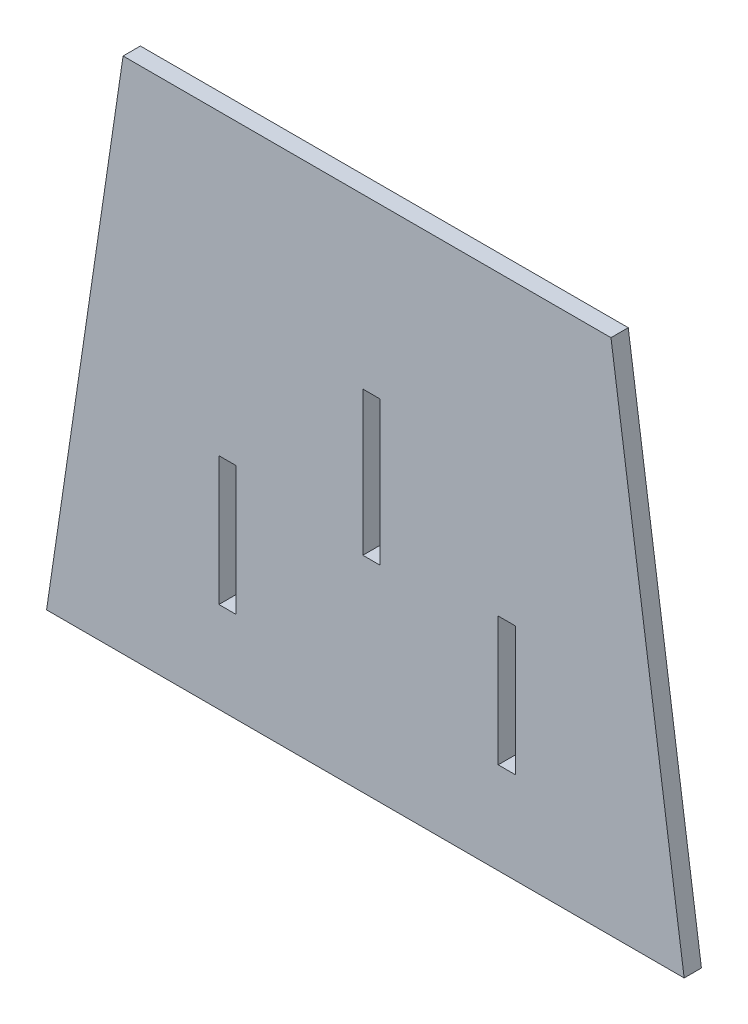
from build123d import *

# Parameters (mm, degrees)
SKETCH1_W           = 1.524
SKETCH1_H           = 12.7
BOSS_EXTRUDE1_DEPTH = 1.524
SKETCH2_W           = 1.524
SKETCH2_H           = 11.37039684
CUT_EXTRUDE1_DEPTH  = 2.54


with BuildPart() as part:
    # Sketch1 → Boss-Extrude1 (new body)
    with BuildSketch(Plane.XY):
        Polygon((28.343771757, -11.852606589), (-27.902219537, -11.852606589), (-21.152375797, 33.838953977), (21.887219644, 33.838953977), align=None)
        with Locations((0.762, 12.621342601)):
            Rectangle(SKETCH1_W, SKETCH1_H, mode=Mode.SUBTRACT)
    extrude(amount=BOSS_EXTRUDE1_DEPTH)

    # Sketch2 → Cut-Extrude1 (cut)
    with BuildSketch(Plane.XY.offset(1.524)):
        with Locations((12.7, 1.915747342)):
            Rectangle(SKETCH2_W, SKETCH2_H)
        with Locations((-11.937778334, 1.845064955)):
            Rectangle(SKETCH2_W, SKETCH2_H)
    extrude(amount=-CUT_EXTRUDE1_DEPTH, mode=Mode.SUBTRACT)


solid = part.part
